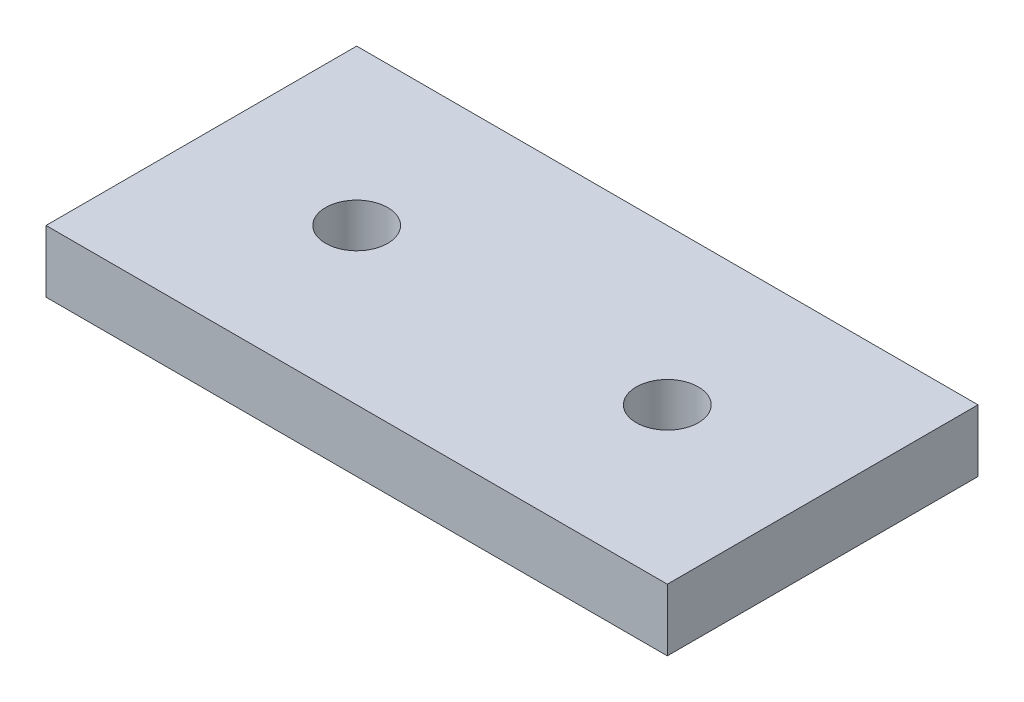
from build123d import *

# Parameters (mm, degrees)
SKETCH1_W           = 100
SKETCH1_H           = 50
BOSS_EXTRUDE1_DEPTH = 10
SKETCH2_R           = 5
CUT_EXTRUDE1_DEPTH  = 10


with BuildPart() as part:
    # Sketch1 → Boss-Extrude1 (new body)
    with BuildSketch(Plane(origin=(0, 0, 0), x_dir=(1, 0, 0), z_dir=(0, 1, 0))):
        Rectangle(SKETCH1_W, SKETCH1_H)
    extrude(amount=BOSS_EXTRUDE1_DEPTH)

    # Sketch2 → Cut-Extrude1 (cut)
    with BuildSketch(Plane(origin=(0, 10, 0), x_dir=(1, 0, 0), z_dir=(0, 1, 0))):
        with Locations(Location((-25, 0, 0), (0, 0, 270))):
            Circle(SKETCH2_R)
        with Locations(Location((25, 0, 0), (0, 0, 90))):
            Circle(SKETCH2_R)
    extrude(amount=-CUT_EXTRUDE1_DEPTH, mode=Mode.SUBTRACT)


solid = part.part
